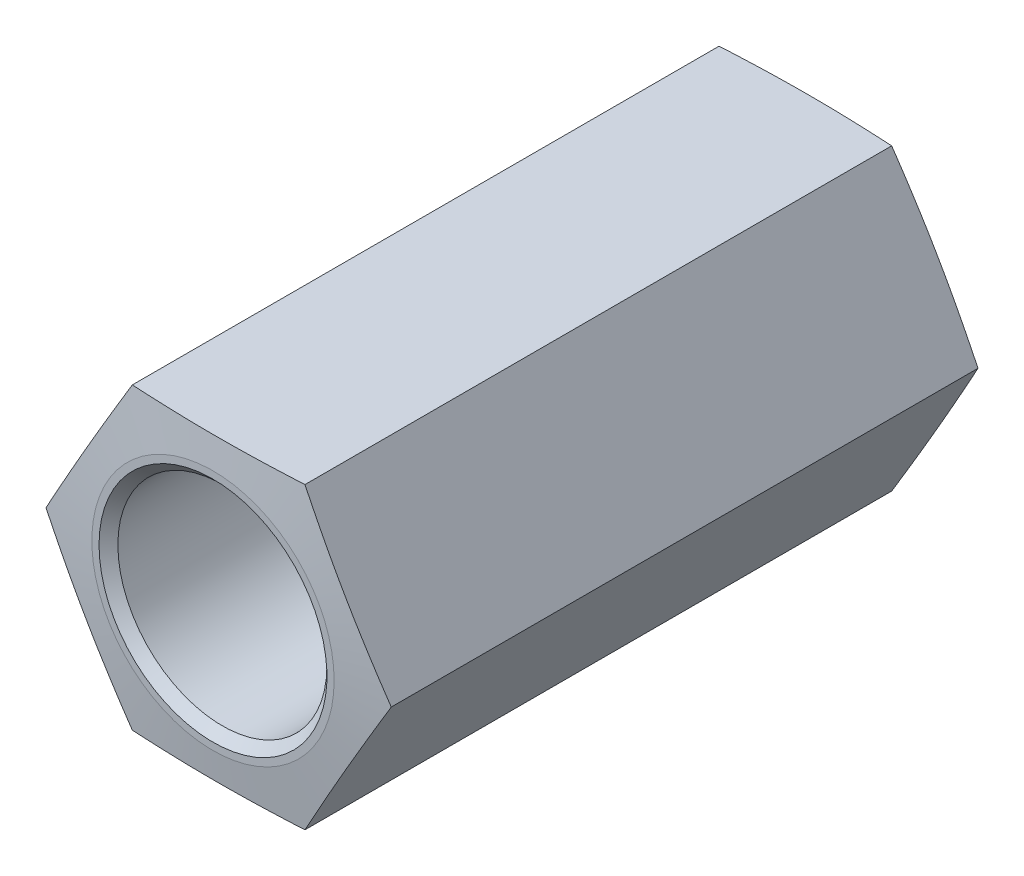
ISO-10303-21;
HEADER;
FILE_DESCRIPTION(('STEP AP214'),'2;1');
FILE_NAME('part.step','',(''),(''),'','','');
FILE_SCHEMA(('AUTOMOTIVE_DESIGN { 1 0 10303 214 1 1 1 1 }'));
ENDSEC;
DATA;
#1=APPLICATION_CONTEXT('core data for automotive mechanical design processes');
#2=APPLICATION_PROTOCOL_DEFINITION('international standard','automotive_design',2000,#1);
#3=PRODUCT_CONTEXT('',#1,'mechanical');
#4=PRODUCT('Part','Part','',(#3));
#5=PRODUCT_RELATED_PRODUCT_CATEGORY('part','',(#4));
#6=PRODUCT_DEFINITION_FORMATION('','',#4);
#7=PRODUCT_DEFINITION_CONTEXT('part definition',#1,'design');
#8=PRODUCT_DEFINITION('design','',#6,#7);
#9=PRODUCT_DEFINITION_SHAPE('','',#8);
#10=(LENGTH_UNIT() NAMED_UNIT(*) SI_UNIT(.MILLI.,.METRE.));
#11=(NAMED_UNIT(*) PLANE_ANGLE_UNIT() SI_UNIT($,.RADIAN.));
#12=(NAMED_UNIT(*) SI_UNIT($,.STERADIAN.) SOLID_ANGLE_UNIT());
#13=UNCERTAINTY_MEASURE_WITH_UNIT(LENGTH_MEASURE(1.E-05),#10,'distance_accuracy_value','');
#14=(GEOMETRIC_REPRESENTATION_CONTEXT(3) GLOBAL_UNCERTAINTY_ASSIGNED_CONTEXT((#13)) GLOBAL_UNIT_ASSIGNED_CONTEXT((#10,
#11,#12)) REPRESENTATION_CONTEXT('',''));
#15=CARTESIAN_POINT('',(0.,0.,0.));
#16=DIRECTION('',(0.,0.,1.));
#17=DIRECTION('',(1.,0.,0.));
#18=AXIS2_PLACEMENT_3D('',#15,#16,#17);
#19=CARTESIAN_POINT('',(3.6427233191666E-08,6.34999999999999,6.35));
#20=DIRECTION('',(0.,0.,-1.));
#21=DIRECTION('',(-1.,0.,0.));
#22=AXIS2_PLACEMENT_3D('',#19,#20,#21);
#23=PLANE('',#22);
#24=CARTESIAN_POINT('',(0.,-6.30938595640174E-08,6.35));
#25=DIRECTION('',(0.,0.,1.));
#26=DIRECTION('',(1.,0.,0.));
#27=AXIS2_PLACEMENT_3D('',#24,#25,#26);
#28=CIRCLE('',#27,2.57273925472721);
#29=CARTESIAN_POINT('',(2.57273925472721,-6.30938595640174E-08,6.35));
#30=VERTEX_POINT('',#29);
#31=EDGE_CURVE('E102',#30,#30,#28,.T.);
#32=ORIENTED_EDGE('',*,*,#31,.T.);
#33=EDGE_LOOP('',(#32));
#34=FACE_BOUND('',#33,.T.);
#35=CARTESIAN_POINT('',(0.,-6.30938595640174E-08,6.35));
#36=DIRECTION('',(0.,0.,-1.));
#37=DIRECTION('',(-1.,0.,0.));
#38=AXIS2_PLACEMENT_3D('',#35,#36,#37);
#39=CIRCLE('',#38,2.42000000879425);
#40=CARTESIAN_POINT('',(-2.42000000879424,-6.30938595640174E-08,6.35));
#41=VERTEX_POINT('',#40);
#42=EDGE_CURVE('E124',#41,#41,#39,.T.);
#43=ORIENTED_EDGE('',*,*,#42,.T.);
#44=EDGE_LOOP('',(#43));
#45=FACE_BOUND('',#44,.T.);
#46=ADVANCED_FACE('F30',(#34,#45),#23,.F.);
#47=CARTESIAN_POINT('',(3.6427233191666E-08,6.34999999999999,-6.35));
#48=DIRECTION('',(0.,0.,-1.));
#49=DIRECTION('',(-1.,0.,0.));
#50=AXIS2_PLACEMENT_3D('',#47,#48,#49);
#51=PLANE('',#50);
#52=CARTESIAN_POINT('',(0.,-6.30938595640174E-08,-6.35));
#53=DIRECTION('',(0.,0.,1.));
#54=DIRECTION('',(1.,0.,0.));
#55=AXIS2_PLACEMENT_3D('',#52,#53,#54);
#56=CIRCLE('',#55,2.57273925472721);
#57=CARTESIAN_POINT('',(2.57273925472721,-6.30938595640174E-08,-6.35));
#58=VERTEX_POINT('',#57);
#59=EDGE_CURVE('E222',#58,#58,#56,.T.);
#60=ORIENTED_EDGE('',*,*,#59,.F.);
#61=EDGE_LOOP('',(#60));
#62=FACE_BOUND('',#61,.T.);
#63=CARTESIAN_POINT('',(0.,-6.30938595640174E-08,-6.35));
#64=DIRECTION('',(0.,0.,-1.));
#65=DIRECTION('',(-1.,0.,0.));
#66=AXIS2_PLACEMENT_3D('',#63,#64,#65);
#67=CIRCLE('',#66,2.42000000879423);
#68=CARTESIAN_POINT('',(-2.42000000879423,-6.30938595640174E-08,-6.35));
#69=VERTEX_POINT('',#68);
#70=EDGE_CURVE('E127',#69,#69,#67,.F.);
#71=ORIENTED_EDGE('',*,*,#70,.T.);
#72=EDGE_LOOP('',(#71));
#73=FACE_BOUND('',#72,.T.);
#74=ADVANCED_FACE('F144',(#62,#73),#51,.T.);
#75=CARTESIAN_POINT('',(-1.83308710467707,3.17499993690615,6.35));
#76=DIRECTION('',(0.866025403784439,-0.5,0.));
#77=DIRECTION('',(0.5,0.866025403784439,0.));
#78=AXIS2_PLACEMENT_3D('',#75,#76,#77);
#79=PLANE('',#78);
#80=DIRECTION('',(0.,0.,-1.));
#81=VECTOR('',#80,1.);
#82=CARTESIAN_POINT('',(-3.66617420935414,-6.30938550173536E-08,6.35));
#83=LINE('',#82,#81);
#84=CARTESIAN_POINT('',(-3.66617420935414,-6.30938541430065E-08,6.23));
#85=VERTEX_POINT('',#84);
#86=CARTESIAN_POINT('',(-3.66617420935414,-6.30938541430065E-08,-6.23));
#87=VERTEX_POINT('',#86);
#88=EDGE_CURVE('E116',#85,#87,#83,.T.);
#89=ORIENTED_EDGE('',*,*,#88,.F.);
#90=CARTESIAN_POINT('',(-3.66628967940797,-0.000200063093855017,6.22998732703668));
#91=CARTESIAN_POINT('',(-3.58994462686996,0.132033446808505,6.23837017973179));
#92=CARTESIAN_POINT('',(-3.51357601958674,0.264307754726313,6.24596501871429));
#93=CARTESIAN_POINT('',(-3.36079345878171,0.528934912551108,6.25929019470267));
#94=CARTESIAN_POINT('',(-3.28437950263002,0.661287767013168,6.26502041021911));
#95=CARTESIAN_POINT('',(-3.13158459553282,0.925936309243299,6.27432264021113));
#96=CARTESIAN_POINT('',(-3.05520367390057,1.05823194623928,6.27789653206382));
#97=CARTESIAN_POINT('',(-2.90242538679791,1.32285170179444,6.28268735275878));
#98=CARTESIAN_POINT('',(-2.82602802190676,1.45517581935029,6.28390435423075));
#99=CARTESIAN_POINT('',(-2.67323329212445,1.719824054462,6.28390435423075));
#100=CARTESIAN_POINT('',(-2.5968359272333,1.85214817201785,6.28268735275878));
#101=CARTESIAN_POINT('',(-2.44405764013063,2.11676792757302,6.27789653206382));
#102=CARTESIAN_POINT('',(-2.36767671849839,2.249063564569,6.27432264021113));
#103=CARTESIAN_POINT('',(-2.21488181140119,2.51371210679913,6.26502041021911));
#104=CARTESIAN_POINT('',(-2.1384678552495,2.64606496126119,6.25929019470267));
#105=CARTESIAN_POINT('',(-1.98568529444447,2.91069211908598,6.24596501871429));
#106=CARTESIAN_POINT('',(-1.90931668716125,3.04296642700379,6.23837017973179));
#107=CARTESIAN_POINT('',(-1.83297163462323,3.17519993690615,6.22998732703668));
#108=B_SPLINE_CURVE_WITH_KNOTS('',3,(#90,#91,#92,#93,#94,#95,#96,#97,#98,#99,#100,#101,#102,
#103,#104,#105,#106,#107),.UNSPECIFIED.,.F.,.F.,(4,2,2,2,2,2,2,2,4),(0.,0.458763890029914,
0.917557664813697,1.37595141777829,1.83433104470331,2.29271067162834,2.75110442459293,
3.20989819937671,3.66866208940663),.UNSPECIFIED.);
#109=CARTESIAN_POINT('',(-1.83308710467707,3.17499993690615,6.23));
#110=VERTEX_POINT('',#109);
#111=EDGE_CURVE('E187',#85,#110,#108,.T.);
#112=ORIENTED_EDGE('',*,*,#111,.T.);
#113=DIRECTION('',(0.,0.,-1.));
#114=VECTOR('',#113,1.);
#115=CARTESIAN_POINT('',(-1.83308710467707,3.17499993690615,6.35));
#116=LINE('',#115,#114);
#117=CARTESIAN_POINT('',(-1.83308710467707,3.17499993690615,-6.23));
#118=VERTEX_POINT('',#117);
#119=EDGE_CURVE('E57',#110,#118,#116,.T.);
#120=ORIENTED_EDGE('',*,*,#119,.T.);
#121=CARTESIAN_POINT('',(-1.83297163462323,3.17519993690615,-6.22998732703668));
#122=CARTESIAN_POINT('',(-1.90931668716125,3.04296642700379,-6.23837017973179));
#123=CARTESIAN_POINT('',(-1.98568529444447,2.91069211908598,-6.24596501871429));
#124=CARTESIAN_POINT('',(-2.1384678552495,2.64606496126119,-6.25929019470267));
#125=CARTESIAN_POINT('',(-2.21488181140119,2.51371210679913,-6.26502041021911));
#126=CARTESIAN_POINT('',(-2.36767671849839,2.249063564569,-6.27432264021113));
#127=CARTESIAN_POINT('',(-2.44405764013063,2.11676792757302,-6.27789653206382));
#128=CARTESIAN_POINT('',(-2.5968359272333,1.85214817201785,-6.28268735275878));
#129=CARTESIAN_POINT('',(-2.67323329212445,1.719824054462,-6.28390435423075));
#130=CARTESIAN_POINT('',(-2.82602802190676,1.45517581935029,-6.28390435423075));
#131=CARTESIAN_POINT('',(-2.90242538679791,1.32285170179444,-6.28268735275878));
#132=CARTESIAN_POINT('',(-3.05520367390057,1.05823194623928,-6.27789653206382));
#133=CARTESIAN_POINT('',(-3.13158459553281,0.925936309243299,-6.27432264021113));
#134=CARTESIAN_POINT('',(-3.28437950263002,0.661287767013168,-6.26502041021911));
#135=CARTESIAN_POINT('',(-3.36079345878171,0.528934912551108,-6.25929019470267));
#136=CARTESIAN_POINT('',(-3.51357601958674,0.264307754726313,-6.24596501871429));
#137=CARTESIAN_POINT('',(-3.58994462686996,0.132033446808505,-6.23837017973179));
#138=CARTESIAN_POINT('',(-3.66628967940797,-0.000200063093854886,-6.22998732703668));
#139=B_SPLINE_CURVE_WITH_KNOTS('',3,(#121,#122,#123,#124,#125,#126,#127,#128,#129,#130,#131,
#132,#133,#134,#135,#136,#137,#138),.UNSPECIFIED.,.F.,.F.,(4,2,2,2,2,2,2,2,4),(0.,
0.458763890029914,0.917557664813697,1.37595141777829,1.83433104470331,2.29271067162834,
2.75110442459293,3.20989819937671,3.66866208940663),.UNSPECIFIED.);
#140=EDGE_CURVE('E209',#118,#87,#139,.T.);
#141=ORIENTED_EDGE('',*,*,#140,.T.);
#142=EDGE_LOOP('',(#89,#112,#120,#141));
#143=FACE_BOUND('',#142,.T.);
#144=ADVANCED_FACE('F196',(#143),#79,.F.);
#145=CARTESIAN_POINT('',(-3.66617420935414,-6.30938550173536E-08,6.35));
#146=DIRECTION('',(0.866025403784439,0.5,0.));
#147=DIRECTION('',(-0.5,0.866025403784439,0.));
#148=AXIS2_PLACEMENT_3D('',#145,#146,#147);
#149=PLANE('',#148);
#150=DIRECTION('',(0.,0.,-1.));
#151=VECTOR('',#150,1.);
#152=CARTESIAN_POINT('',(-1.83308710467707,-3.17500006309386,6.35));
#153=LINE('',#152,#151);
#154=CARTESIAN_POINT('',(-1.83308710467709,-3.17500006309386,6.23));
#155=VERTEX_POINT('',#154);
#156=CARTESIAN_POINT('',(-1.83308710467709,-3.17500006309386,-6.23));
#157=VERTEX_POINT('',#156);
#158=EDGE_CURVE('E110',#155,#157,#153,.T.);
#159=ORIENTED_EDGE('',*,*,#158,.F.);
#160=CARTESIAN_POINT('',(-1.83297163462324,-3.17520006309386,6.22998732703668));
#161=CARTESIAN_POINT('',(-1.90931668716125,-3.0429665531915,6.23837017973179));
#162=CARTESIAN_POINT('',(-1.98568529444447,-2.91069224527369,6.24596501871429));
#163=CARTESIAN_POINT('',(-2.1384678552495,-2.6460650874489,6.25929019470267));
#164=CARTESIAN_POINT('',(-2.21488181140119,-2.51371223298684,6.26502041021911));
#165=CARTESIAN_POINT('',(-2.36767671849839,-2.24906369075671,6.27432264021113));
#166=CARTESIAN_POINT('',(-2.44405764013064,-2.11676805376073,6.27789653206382));
#167=CARTESIAN_POINT('',(-2.5968359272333,-1.85214829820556,6.28268735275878));
#168=CARTESIAN_POINT('',(-2.67323329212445,-1.71982418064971,6.28390435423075));
#169=CARTESIAN_POINT('',(-2.82602802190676,-1.455175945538,6.28390435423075));
#170=CARTESIAN_POINT('',(-2.90242538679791,-1.32285182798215,6.28268735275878));
#171=CARTESIAN_POINT('',(-3.05520367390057,-1.05823207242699,6.27789653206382));
#172=CARTESIAN_POINT('',(-3.13158459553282,-0.925936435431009,6.27432264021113));
#173=CARTESIAN_POINT('',(-3.28437950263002,-0.661287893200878,6.26502041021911));
#174=CARTESIAN_POINT('',(-3.36079345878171,-0.528935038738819,6.25929019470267));
#175=CARTESIAN_POINT('',(-3.51357601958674,-0.264307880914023,6.24596501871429));
#176=CARTESIAN_POINT('',(-3.58994462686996,-0.132033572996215,6.23837017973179));
#177=CARTESIAN_POINT('',(-3.66628967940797,0.000199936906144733,6.22998732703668));
#178=B_SPLINE_CURVE_WITH_KNOTS('',3,(#160,#161,#162,#163,#164,#165,#166,#167,#168,#169,#170,
#171,#172,#173,#174,#175,#176,#177),.UNSPECIFIED.,.F.,.F.,(4,2,2,2,2,2,2,2,4),(0.,
0.458763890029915,0.917557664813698,1.37595141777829,1.83433104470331,2.29271067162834,
2.75110442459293,3.20989819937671,3.66866208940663),.UNSPECIFIED.);
#179=EDGE_CURVE('E181',#155,#85,#178,.T.);
#180=ORIENTED_EDGE('',*,*,#179,.T.);
#181=ORIENTED_EDGE('',*,*,#88,.T.);
#182=CARTESIAN_POINT('',(-3.66628967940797,0.000199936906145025,-6.22998732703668));
#183=CARTESIAN_POINT('',(-3.58994462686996,-0.132033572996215,-6.23837017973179));
#184=CARTESIAN_POINT('',(-3.51357601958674,-0.264307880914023,-6.24596501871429));
#185=CARTESIAN_POINT('',(-3.36079345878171,-0.528935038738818,-6.25929019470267));
#186=CARTESIAN_POINT('',(-3.28437950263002,-0.661287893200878,-6.26502041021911));
#187=CARTESIAN_POINT('',(-3.13158459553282,-0.925936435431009,-6.27432264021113));
#188=CARTESIAN_POINT('',(-3.05520367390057,-1.05823207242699,-6.27789653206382));
#189=CARTESIAN_POINT('',(-2.90242538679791,-1.32285182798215,-6.28268735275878));
#190=CARTESIAN_POINT('',(-2.82602802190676,-1.455175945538,-6.28390435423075));
#191=CARTESIAN_POINT('',(-2.67323329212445,-1.71982418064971,-6.28390435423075));
#192=CARTESIAN_POINT('',(-2.5968359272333,-1.85214829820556,-6.28268735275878));
#193=CARTESIAN_POINT('',(-2.44405764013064,-2.11676805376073,-6.27789653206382));
#194=CARTESIAN_POINT('',(-2.36767671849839,-2.24906369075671,-6.27432264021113));
#195=CARTESIAN_POINT('',(-2.21488181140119,-2.51371223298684,-6.26502041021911));
#196=CARTESIAN_POINT('',(-2.1384678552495,-2.6460650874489,-6.25929019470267));
#197=CARTESIAN_POINT('',(-1.98568529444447,-2.91069224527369,-6.24596501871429));
#198=CARTESIAN_POINT('',(-1.90931668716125,-3.0429665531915,-6.23837017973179));
#199=CARTESIAN_POINT('',(-1.83297163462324,-3.17520006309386,-6.22998732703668));
#200=B_SPLINE_CURVE_WITH_KNOTS('',3,(#182,#183,#184,#185,#186,#187,#188,#189,#190,#191,#192,
#193,#194,#195,#196,#197,#198,#199),.UNSPECIFIED.,.F.,.F.,(4,2,2,2,2,2,2,2,4),(0.,
0.458763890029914,0.917557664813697,1.37595141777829,1.83433104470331,2.29271067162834,
2.75110442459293,3.20989819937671,3.66866208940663),.UNSPECIFIED.);
#201=EDGE_CURVE('E202',#87,#157,#200,.T.);
#202=ORIENTED_EDGE('',*,*,#201,.T.);
#203=EDGE_LOOP('',(#159,#180,#181,#202));
#204=FACE_BOUND('',#203,.T.);
#205=ADVANCED_FACE('F192',(#204),#149,.F.);
#206=CARTESIAN_POINT('',(-1.83308710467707,-3.17500006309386,6.35));
#207=DIRECTION('',(-3.44194550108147E-08,0.999999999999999,0.));
#208=DIRECTION('',(-0.999999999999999,-3.44194550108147E-08,0.));
#209=AXIS2_PLACEMENT_3D('',#206,#207,#208);
#210=PLANE('',#209);
#211=DIRECTION('',(0.,0.,-1.));
#212=VECTOR('',#211,1.);
#213=CARTESIAN_POINT('',(1.83308710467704,-3.17499993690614,6.35));
#214=LINE('',#213,#212);
#215=CARTESIAN_POINT('',(1.83308699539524,-3.17500012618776,6.23));
#216=VERTEX_POINT('',#215);
#217=CARTESIAN_POINT('',(1.83308699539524,-3.17500012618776,-6.23));
#218=VERTEX_POINT('',#217);
#219=EDGE_CURVE('E108',#216,#218,#214,.T.);
#220=ORIENTED_EDGE('',*,*,#219,.F.);
#221=CARTESIAN_POINT('',(-4.83494791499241,-3.17500016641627,5.99755177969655));
#222=CARTESIAN_POINT('',(-4.69083344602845,-3.17500016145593,6.01077005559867));
#223=CARTESIAN_POINT('',(-4.54670317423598,-3.17500015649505,6.02381620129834));
#224=CARTESIAN_POINT('',(-4.25840335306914,-3.17500014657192,6.04947917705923));
#225=CARTESIAN_POINT('',(-4.11423380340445,-3.17500014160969,6.06209600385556));
#226=CARTESIAN_POINT('',(-3.68161123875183,-3.17500012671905,6.09917863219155));
#227=CARTESIAN_POINT('',(-3.39309105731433,-3.17500011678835,6.12287223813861));
#228=CARTESIAN_POINT('',(-2.8161799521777,-3.17500009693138,6.16713632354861));
#229=CARTESIAN_POINT('',(-2.52778933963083,-3.17500008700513,6.18771078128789));
#230=CARTESIAN_POINT('',(-1.95071438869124,-3.17500006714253,6.22421217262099));
#231=CARTESIAN_POINT('',(-1.66203005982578,-3.17500005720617,6.2401392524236));
#232=CARTESIAN_POINT('',(-1.08383678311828,-3.17500003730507,6.26530552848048));
#233=CARTESIAN_POINT('',(-0.794327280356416,-3.17500002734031,6.27453282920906));
#234=CARTESIAN_POINT('',(-0.359965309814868,-3.17500001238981,6.28202648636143));
#235=CARTESIAN_POINT('',(-0.21516514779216,-3.17500000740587,6.28346653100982));
#236=CARTESIAN_POINT('',(0.0744404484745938,-3.1749999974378,6.28417108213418));
#237=CARTESIAN_POINT('',(0.219245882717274,-3.17499999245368,6.28343558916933));
#238=CARTESIAN_POINT('',(0.653794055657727,-3.17499997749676,6.27799104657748));
#239=CARTESIAN_POINT('',(0.943499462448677,-3.17499996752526,6.27004101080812));
#240=CARTESIAN_POINT('',(1.52263859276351,-3.17499994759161,6.24705711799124));
#241=CARTESIAN_POINT('',(1.81207228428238,-3.17499993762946,6.23202251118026));
#242=CARTESIAN_POINT('',(2.37658945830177,-3.17499991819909,6.19782984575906));
#243=CARTESIAN_POINT('',(2.65168769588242,-3.17499990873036,6.17890730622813));
#244=CARTESIAN_POINT('',(3.20165867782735,-3.17499988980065,6.13799900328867));
#245=CARTESIAN_POINT('',(3.47653141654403,-3.17499988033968,6.11601316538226));
#246=CARTESIAN_POINT('',(4.02611836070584,-3.1749998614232,6.06997277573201));
#247=CARTESIAN_POINT('',(4.30083255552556,-3.17499985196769,6.04591809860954));
#248=CARTESIAN_POINT('',(4.85013324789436,-3.17499983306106,5.99638968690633));
#249=CARTESIAN_POINT('',(5.1247197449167,-3.17499982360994,5.97091594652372));
#250=CARTESIAN_POINT('',(5.67334348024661,-3.17499980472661,5.91901454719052));
#251=CARTESIAN_POINT('',(5.94738087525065,-3.17499979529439,5.89258853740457));
#252=CARTESIAN_POINT('',(6.4953862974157,-3.17499977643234,5.8390190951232));
#253=CARTESIAN_POINT('',(6.76935432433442,-3.17499976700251,5.81187566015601));
#254=CARTESIAN_POINT('',(7.31716608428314,-3.17499974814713,5.75706763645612));
#255=CARTESIAN_POINT('',(7.59100983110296,-3.17499973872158,5.72940318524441));
#256=CARTESIAN_POINT('',(8.13865420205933,-3.17499971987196,5.67366761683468));
#257=CARTESIAN_POINT('',(8.41245482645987,-3.17499971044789,5.64559650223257));
#258=CARTESIAN_POINT('',(8.68624054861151,-3.17499970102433,5.61738255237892));
#259=B_SPLINE_CURVE_WITH_KNOTS('',3,(#221,#222,#223,#224,#225,#226,#227,#228,#229,#230,#231,
#232,#233,#234,#235,#236,#237,#238,#239,#240,#241,#242,#243,#244,#245,#246,#247,#248,#249,#250,
#251,#252,#253,#254,#255,#256,#257,#258),.UNSPECIFIED.,.F.,.F.,(4,2,2,2,2,2,2,2,2,2,2,2,2,2,2,2,
2,2,4),(0.,0.434157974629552,0.868319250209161,1.7367826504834,2.60412888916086,
3.47144783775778,4.34030297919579,4.77470987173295,5.20911665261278,6.07843767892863,
6.94785072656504,7.77507130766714,8.60231200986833,9.42960288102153,10.2568971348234,
11.0828216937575,11.9087490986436,12.734461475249,13.5601685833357),.UNSPECIFIED.);
#260=EDGE_CURVE('E90',#216,#155,#259,.F.);
#261=ORIENTED_EDGE('',*,*,#260,.T.);
#262=ORIENTED_EDGE('',*,*,#158,.T.);
#263=CARTESIAN_POINT('',(-4.83494791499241,-3.17500016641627,-5.99755177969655));
#264=CARTESIAN_POINT('',(-4.69083344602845,-3.17500016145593,-6.01077005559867));
#265=CARTESIAN_POINT('',(-4.54670317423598,-3.17500015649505,-6.02381620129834));
#266=CARTESIAN_POINT('',(-4.25840335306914,-3.17500014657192,-6.04947917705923));
#267=CARTESIAN_POINT('',(-4.11423380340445,-3.17500014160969,-6.06209600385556));
#268=CARTESIAN_POINT('',(-3.68161123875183,-3.17500012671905,-6.09917863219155));
#269=CARTESIAN_POINT('',(-3.39309105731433,-3.17500011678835,-6.12287223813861));
#270=CARTESIAN_POINT('',(-2.8161799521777,-3.17500009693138,-6.16713632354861));
#271=CARTESIAN_POINT('',(-2.52778933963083,-3.17500008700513,-6.18771078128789));
#272=CARTESIAN_POINT('',(-1.95071438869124,-3.17500006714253,-6.22421217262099));
#273=CARTESIAN_POINT('',(-1.66203005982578,-3.17500005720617,-6.2401392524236));
#274=CARTESIAN_POINT('',(-1.08383678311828,-3.17500003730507,-6.26530552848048));
#275=CARTESIAN_POINT('',(-0.794327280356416,-3.17500002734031,-6.27453282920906));
#276=CARTESIAN_POINT('',(-0.359965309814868,-3.17500001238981,-6.28202648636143));
#277=CARTESIAN_POINT('',(-0.21516514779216,-3.17500000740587,-6.28346653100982));
#278=CARTESIAN_POINT('',(0.0744404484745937,-3.1749999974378,-6.28417108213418));
#279=CARTESIAN_POINT('',(0.219245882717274,-3.17499999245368,-6.28343558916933));
#280=CARTESIAN_POINT('',(0.653794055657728,-3.17499997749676,-6.27799104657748));
#281=CARTESIAN_POINT('',(0.943499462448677,-3.17499996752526,-6.27004101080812));
#282=CARTESIAN_POINT('',(1.52263859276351,-3.17499994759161,-6.24705711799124));
#283=CARTESIAN_POINT('',(1.81207228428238,-3.17499993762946,-6.23202251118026));
#284=CARTESIAN_POINT('',(2.37658945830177,-3.17499991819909,-6.19782984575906));
#285=CARTESIAN_POINT('',(2.65168769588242,-3.17499990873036,-6.17890730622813));
#286=CARTESIAN_POINT('',(3.20165867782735,-3.17499988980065,-6.13799900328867));
#287=CARTESIAN_POINT('',(3.47653141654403,-3.17499988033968,-6.11601316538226));
#288=CARTESIAN_POINT('',(4.02611836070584,-3.1749998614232,-6.06997277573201));
#289=CARTESIAN_POINT('',(4.30083255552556,-3.17499985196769,-6.04591809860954));
#290=CARTESIAN_POINT('',(4.85013324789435,-3.17499983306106,-5.99638968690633));
#291=CARTESIAN_POINT('',(5.1247197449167,-3.17499982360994,-5.97091594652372));
#292=CARTESIAN_POINT('',(5.67334348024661,-3.17499980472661,-5.91901454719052));
#293=CARTESIAN_POINT('',(5.94738087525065,-3.17499979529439,-5.89258853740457));
#294=CARTESIAN_POINT('',(6.4953862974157,-3.17499977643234,-5.8390190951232));
#295=CARTESIAN_POINT('',(6.76935432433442,-3.17499976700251,-5.81187566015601));
#296=CARTESIAN_POINT('',(7.31716608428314,-3.17499974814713,-5.75706763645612));
#297=CARTESIAN_POINT('',(7.59100983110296,-3.17499973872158,-5.72940318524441));
#298=CARTESIAN_POINT('',(8.13865420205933,-3.17499971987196,-5.67366761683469));
#299=CARTESIAN_POINT('',(8.41245482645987,-3.17499971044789,-5.64559650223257));
#300=CARTESIAN_POINT('',(8.68624054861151,-3.17499970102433,-5.61738255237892));
#301=B_SPLINE_CURVE_WITH_KNOTS('',3,(#263,#264,#265,#266,#267,#268,#269,#270,#271,#272,#273,
#274,#275,#276,#277,#278,#279,#280,#281,#282,#283,#284,#285,#286,#287,#288,#289,#290,#291,#292,
#293,#294,#295,#296,#297,#298,#299,#300),.UNSPECIFIED.,.F.,.F.,(4,2,2,2,2,2,2,2,2,2,2,2,2,2,2,2,
2,2,4),(0.,0.434157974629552,0.868319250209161,1.7367826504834,2.60412888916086,
3.47144783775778,4.34030297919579,4.77470987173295,5.20911665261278,6.07843767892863,
6.94785072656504,7.77507130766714,8.60231200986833,9.42960288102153,10.2568971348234,
11.0828216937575,11.9087490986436,12.734461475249,13.5601685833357),.UNSPECIFIED.);
#302=EDGE_CURVE('E210',#157,#218,#301,.T.);
#303=ORIENTED_EDGE('',*,*,#302,.T.);
#304=EDGE_LOOP('',(#220,#261,#262,#303));
#305=FACE_BOUND('',#304,.T.);
#306=ADVANCED_FACE('F195',(#305),#210,.F.);
#307=CARTESIAN_POINT('',(1.83308710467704,-3.17499993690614,6.35));
#308=DIRECTION('',(-0.866025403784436,0.500000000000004,0.));
#309=DIRECTION('',(-0.500000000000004,-0.866025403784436,0.));
#310=AXIS2_PLACEMENT_3D('',#307,#308,#309);
#311=PLANE('',#310);
#312=DIRECTION('',(0.,0.,-1.));
#313=VECTOR('',#312,1.);
#314=CARTESIAN_POINT('',(3.66617420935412,6.3093853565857E-08,6.35));
#315=LINE('',#314,#313);
#316=CARTESIAN_POINT('',(3.66617420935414,6.30938224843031E-08,6.23));
#317=VERTEX_POINT('',#316);
#318=CARTESIAN_POINT('',(3.66617420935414,6.30938224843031E-08,-6.23));
#319=VERTEX_POINT('',#318);
#320=EDGE_CURVE('E99',#317,#319,#315,.T.);
#321=ORIENTED_EDGE('',*,*,#320,.F.);
#322=CARTESIAN_POINT('',(3.66628967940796,0.000200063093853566,6.22998732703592));
#323=CARTESIAN_POINT('',(3.58994462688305,-0.132033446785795,6.23837018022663));
#324=CARTESIAN_POINT('',(3.51357601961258,-0.264307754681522,6.24596501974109));
#325=CARTESIAN_POINT('',(3.36079345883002,-0.528934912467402,6.25929019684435));
#326=CARTESIAN_POINT('',(3.28437950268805,-0.661287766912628,6.2650204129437));
#327=CARTESIAN_POINT('',(3.13158459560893,-0.925936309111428,6.27432264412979));
#328=CARTESIAN_POINT('',(3.05520367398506,-1.0582319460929,6.27789653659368));
#329=CARTESIAN_POINT('',(2.90242538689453,-1.32285170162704,6.28268735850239));
#330=CARTESIAN_POINT('',(2.82602802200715,-1.45517581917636,6.2839043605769));
#331=CARTESIAN_POINT('',(2.67323329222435,-1.71982405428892,6.28390436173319));
#332=CARTESIAN_POINT('',(2.59683592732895,-1.85214817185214,6.28268736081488));
#333=CARTESIAN_POINT('',(2.44405764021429,-2.11676792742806,6.27789654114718));
#334=CARTESIAN_POINT('',(2.36767671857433,-2.24906356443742,6.27432264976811));
#335=CARTESIAN_POINT('',(2.21488181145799,-2.51371210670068,6.26502042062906));
#336=CARTESIAN_POINT('',(2.1384678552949,-2.64606496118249,6.25929020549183));
#337=CARTESIAN_POINT('',(1.9856852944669,-2.91069211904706,6.24596503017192));
#338=CARTESIAN_POINT('',(1.90931668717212,-3.0429664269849,6.23837019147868));
#339=CARTESIAN_POINT('',(1.8329716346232,-3.17519993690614,6.22998733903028));
#340=B_SPLINE_CURVE_WITH_KNOTS('',3,(#322,#323,#324,#325,#326,#327,#328,#329,#330,#331,#332,
#333,#334,#335,#336,#337,#338,#339),.UNSPECIFIED.,.F.,.F.,(4,2,2,2,2,2,2,2,4),(0.,
0.45876389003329,0.917557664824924,1.37595141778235,1.8343310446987,2.29271067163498,
2.75110442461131,3.20989819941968,3.66866208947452),.UNSPECIFIED.);
#341=EDGE_CURVE('E87',#317,#216,#340,.T.);
#342=ORIENTED_EDGE('',*,*,#341,.T.);
#343=ORIENTED_EDGE('',*,*,#219,.T.);
#344=CARTESIAN_POINT('',(1.8329716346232,-3.17519993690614,-6.22998733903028));
#345=CARTESIAN_POINT('',(1.90931668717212,-3.0429664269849,-6.23837019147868));
#346=CARTESIAN_POINT('',(1.9856852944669,-2.91069211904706,-6.24596503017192));
#347=CARTESIAN_POINT('',(2.1384678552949,-2.64606496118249,-6.25929020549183));
#348=CARTESIAN_POINT('',(2.21488181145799,-2.51371210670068,-6.26502042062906));
#349=CARTESIAN_POINT('',(2.36767671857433,-2.24906356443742,-6.27432264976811));
#350=CARTESIAN_POINT('',(2.44405764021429,-2.11676792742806,-6.27789654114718));
#351=CARTESIAN_POINT('',(2.59683592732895,-1.85214817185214,-6.28268736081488));
#352=CARTESIAN_POINT('',(2.67323329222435,-1.71982405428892,-6.28390436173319));
#353=CARTESIAN_POINT('',(2.82602802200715,-1.45517581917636,-6.2839043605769));
#354=CARTESIAN_POINT('',(2.90242538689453,-1.32285170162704,-6.28268735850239));
#355=CARTESIAN_POINT('',(3.05520367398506,-1.0582319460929,-6.27789653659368));
#356=CARTESIAN_POINT('',(3.13158459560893,-0.925936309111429,-6.27432264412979));
#357=CARTESIAN_POINT('',(3.28437950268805,-0.661287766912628,-6.2650204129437));
#358=CARTESIAN_POINT('',(3.36079345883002,-0.528934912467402,-6.25929019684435));
#359=CARTESIAN_POINT('',(3.51357601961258,-0.264307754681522,-6.24596501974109));
#360=CARTESIAN_POINT('',(3.58994462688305,-0.132033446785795,-6.23837018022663));
#361=CARTESIAN_POINT('',(3.66628967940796,0.000200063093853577,-6.22998732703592));
#362=B_SPLINE_CURVE_WITH_KNOTS('',3,(#344,#345,#346,#347,#348,#349,#350,#351,#352,#353,#354,
#355,#356,#357,#358,#359,#360,#361),.UNSPECIFIED.,.F.,.F.,(4,2,2,2,2,2,2,2,4),(0.,
0.458763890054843,0.917557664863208,1.37595141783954,1.83433104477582,2.29271067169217,
2.7511044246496,3.20989819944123,3.66866208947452),.UNSPECIFIED.);
#363=EDGE_CURVE('E107',#218,#319,#362,.T.);
#364=ORIENTED_EDGE('',*,*,#363,.T.);
#365=EDGE_LOOP('',(#321,#342,#343,#364));
#366=FACE_BOUND('',#365,.T.);
#367=ADVANCED_FACE('F105',(#366),#311,.F.);
#368=CARTESIAN_POINT('',(3.66617420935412,6.3093853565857E-08,6.35));
#369=DIRECTION('',(-0.866025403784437,-0.500000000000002,0.));
#370=DIRECTION('',(0.500000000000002,-0.866025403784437,0.));
#371=AXIS2_PLACEMENT_3D('',#368,#369,#370);
#372=PLANE('',#371);
#373=DIRECTION('',(0.,0.,-1.));
#374=VECTOR('',#373,1.);
#375=CARTESIAN_POINT('',(1.83308710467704,3.17500006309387,6.35));
#376=LINE('',#375,#374);
#377=CARTESIAN_POINT('',(1.83308710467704,3.17500006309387,6.22999998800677));
#378=VERTEX_POINT('',#377);
#379=CARTESIAN_POINT('',(1.83308688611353,3.17500006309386,-6.23));
#380=VERTEX_POINT('',#379);
#381=EDGE_CURVE('E101',#378,#380,#376,.T.);
#382=ORIENTED_EDGE('',*,*,#381,.F.);
#383=CARTESIAN_POINT('',(1.8329716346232,3.17520006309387,6.22998731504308));
#384=CARTESIAN_POINT('',(1.90931668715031,3.04296655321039,6.2383701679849));
#385=CARTESIAN_POINT('',(1.98568529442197,2.91069224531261,6.24596500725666));
#386=CARTESIAN_POINT('',(2.13846785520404,2.64606508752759,6.25929018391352));
#387=CARTESIAN_POINT('',(2.21488181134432,2.51371223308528,6.26502039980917));
#388=CARTESIAN_POINT('',(2.3676767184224,2.24906369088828,6.27432263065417));
#389=CARTESIAN_POINT('',(2.44405764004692,2.11676805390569,6.27789652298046));
#390=CARTESIAN_POINT('',(2.5968359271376,1.85214829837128,6.28268734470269));
#391=CARTESIAN_POINT('',(2.6732332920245,1.71982418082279,6.28390434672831));
#392=CARTESIAN_POINT('',(2.82602802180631,1.45517594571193,6.28390434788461));
#393=CARTESIAN_POINT('',(2.90242538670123,1.32285182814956,6.28268734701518));
#394=CARTESIAN_POINT('',(3.05520367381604,1.05823207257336,6.27789652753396));
#395=CARTESIAN_POINT('',(3.13158459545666,0.925936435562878,6.27432263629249));
#396=CARTESIAN_POINT('',(3.28437950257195,0.661287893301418,6.26502040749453));
#397=CARTESIAN_POINT('',(3.36079345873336,0.528935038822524,6.259290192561));
#398=CARTESIAN_POINT('',(3.51357601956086,0.264307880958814,6.24596501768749));
#399=CARTESIAN_POINT('',(3.58994462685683,0.132033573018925,6.23837017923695));
#400=CARTESIAN_POINT('',(3.66628967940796,-0.000199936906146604,6.22998732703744));
#401=B_SPLINE_CURVE_WITH_KNOTS('',3,(#383,#384,#385,#386,#387,#388,#389,#390,#391,#392,#393,
#394,#395,#396,#397,#398,#399,#400),.UNSPECIFIED.,.F.,.F.,(4,2,2,2,2,2,2,2,4),(0.,
0.458763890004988,0.917557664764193,1.37595141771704,1.83433104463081,2.29271067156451,
2.75110442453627,3.20989819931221,3.66866208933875),.UNSPECIFIED.);
#402=EDGE_CURVE('E50',#378,#317,#401,.T.);
#403=ORIENTED_EDGE('',*,*,#402,.T.);
#404=ORIENTED_EDGE('',*,*,#320,.T.);
#405=CARTESIAN_POINT('',(3.66628967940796,-0.000199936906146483,-6.22998732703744));
#406=CARTESIAN_POINT('',(3.58994462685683,0.132033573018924,-6.23837017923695));
#407=CARTESIAN_POINT('',(3.51357601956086,0.264307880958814,-6.24596501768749));
#408=CARTESIAN_POINT('',(3.36079345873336,0.528935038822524,-6.259290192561));
#409=CARTESIAN_POINT('',(3.28437950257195,0.661287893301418,-6.26502040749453));
#410=CARTESIAN_POINT('',(3.13158459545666,0.925936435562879,-6.27432263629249));
#411=CARTESIAN_POINT('',(3.05520367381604,1.05823207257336,-6.27789652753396));
#412=CARTESIAN_POINT('',(2.90242538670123,1.32285182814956,-6.28268734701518));
#413=CARTESIAN_POINT('',(2.82602802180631,1.45517594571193,-6.28390434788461));
#414=CARTESIAN_POINT('',(2.6732332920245,1.71982418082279,-6.28390434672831));
#415=CARTESIAN_POINT('',(2.5968359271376,1.85214829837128,-6.28268734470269));
#416=CARTESIAN_POINT('',(2.44405764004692,2.11676805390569,-6.27789652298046));
#417=CARTESIAN_POINT('',(2.3676767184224,2.24906369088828,-6.27432263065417));
#418=CARTESIAN_POINT('',(2.21488181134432,2.51371223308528,-6.26502039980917));
#419=CARTESIAN_POINT('',(2.13846785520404,2.64606508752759,-6.25929018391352));
#420=CARTESIAN_POINT('',(1.98568529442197,2.91069224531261,-6.24596500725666));
#421=CARTESIAN_POINT('',(1.90931668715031,3.04296655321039,-6.2383701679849));
#422=CARTESIAN_POINT('',(1.8329716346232,3.17520006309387,-6.22998731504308));
#423=B_SPLINE_CURVE_WITH_KNOTS('',3,(#405,#406,#407,#408,#409,#410,#411,#412,#413,#414,#415,
#416,#417,#418,#419,#420,#421,#422),.UNSPECIFIED.,.F.,.F.,(4,2,2,2,2,2,2,2,4),(0.,
0.45876389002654,0.917557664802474,1.37595141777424,1.83433104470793,2.2927106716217,
2.75110442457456,3.20989819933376,3.66866208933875),.UNSPECIFIED.);
#424=EDGE_CURVE('E154',#319,#380,#423,.T.);
#425=ORIENTED_EDGE('',*,*,#424,.T.);
#426=EDGE_LOOP('',(#382,#403,#404,#425));
#427=FACE_BOUND('',#426,.T.);
#428=ADVANCED_FACE('F97',(#427),#372,.F.);
#429=CARTESIAN_POINT('',(1.83308710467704,3.17500006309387,6.35));
#430=DIRECTION('',(3.44194550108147E-08,-0.999999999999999,0.));
#431=DIRECTION('',(1.,3.44194550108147E-08,0.));
#432=AXIS2_PLACEMENT_3D('',#429,#430,#431);
#433=PLANE('',#432);
#434=ORIENTED_EDGE('',*,*,#119,.F.);
#435=CARTESIAN_POINT('',(-4.83495216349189,3.17499983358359,5.99755140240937));
#436=CARTESIAN_POINT('',(-4.69083751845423,3.17499983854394,6.0107696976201));
#437=CARTESIAN_POINT('',(-4.54670707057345,3.17499984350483,6.02381586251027));
#438=CARTESIAN_POINT('',(-4.25840689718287,3.17499985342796,6.04947887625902));
#439=CARTESIAN_POINT('',(-4.11423717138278,3.17499985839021,6.06209572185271));
#440=CARTESIAN_POINT('',(-3.68161407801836,3.17499987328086,6.09917840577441));
#441=CARTESIAN_POINT('',(-3.39309354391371,3.17499988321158,6.1228720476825));
#442=CARTESIAN_POINT('',(-2.81618173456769,3.17499990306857,6.16713620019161));
#443=CARTESIAN_POINT('',(-2.52779077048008,3.17499991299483,6.18771068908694));
#444=CARTESIAN_POINT('',(-1.95071511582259,3.17499993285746,6.22421213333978));
#445=CARTESIAN_POINT('',(-1.66203043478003,3.17499994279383,6.24013923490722));
#446=CARTESIAN_POINT('',(-1.08383644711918,3.17499996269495,6.26530553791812));
#447=CARTESIAN_POINT('',(-0.794326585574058,3.17499997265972,6.27453284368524));
#448=CARTESIAN_POINT('',(-0.359964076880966,3.17499998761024,6.28202649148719));
#449=CARTESIAN_POINT('',(-0.215163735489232,3.17499999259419,6.28346653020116));
#450=CARTESIAN_POINT('',(0.0744422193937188,3.17500000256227,6.28417106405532));
#451=CARTESIAN_POINT('',(0.219247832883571,3.1750000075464,6.28343555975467));
#452=CARTESIAN_POINT('',(0.653796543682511,3.17500002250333,6.27799097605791));
#453=CARTESIAN_POINT('',(0.943502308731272,3.17500003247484,6.27004090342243));
#454=CARTESIAN_POINT('',(1.52264215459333,3.17500005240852,6.24705692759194));
#455=CARTESIAN_POINT('',(1.81207620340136,3.17500006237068,6.23202227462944));
#456=CARTESIAN_POINT('',(2.37659373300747,3.17500008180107,6.19782953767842));
#457=CARTESIAN_POINT('',(2.65169196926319,3.1750000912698,6.17890697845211));
#458=CARTESIAN_POINT('',(3.20166294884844,3.1750001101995,6.13799864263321));
#459=CARTESIAN_POINT('',(3.47653568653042,3.17500011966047,6.1160127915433));
#460=CARTESIAN_POINT('',(4.02612262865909,3.17500013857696,6.06997237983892));
#461=CARTESIAN_POINT('',(4.30083682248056,3.17500014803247,6.04591769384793));
#462=CARTESIAN_POINT('',(4.85013751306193,3.1750001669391,5.99638926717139));
#463=CARTESIAN_POINT('',(5.12472400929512,3.17500017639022,5.970915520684));
#464=CARTESIAN_POINT('',(5.67334774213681,3.17500019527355,5.91901411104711));
#465=CARTESIAN_POINT('',(5.94738513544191,3.17500020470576,5.89258809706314));
#466=CARTESIAN_POINT('',(6.49539055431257,3.17500022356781,5.83901864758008));
#467=CARTESIAN_POINT('',(6.76935857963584,3.17500023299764,5.81187520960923));
#468=CARTESIAN_POINT('',(7.31717033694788,3.17500025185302,5.75706718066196));
#469=CARTESIAN_POINT('',(7.59101408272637,3.17500026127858,5.72940272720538));
#470=CARTESIAN_POINT('',(8.13865845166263,3.1750002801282,5.67366715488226));
#471=CARTESIAN_POINT('',(8.4124590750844,3.17500028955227,5.64559603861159));
#472=CARTESIAN_POINT('',(8.68624479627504,3.17500029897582,5.61738208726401));
#473=B_SPLINE_CURVE_WITH_KNOTS('',3,(#435,#436,#437,#438,#439,#440,#441,#442,#443,#444,#445,
#446,#447,#448,#449,#450,#451,#452,#453,#454,#455,#456,#457,#458,#459,#460,#461,#462,#463,#464,
#465,#466,#467,#468,#469,#470,#471,#472),.UNSPECIFIED.,.F.,.F.,(4,2,2,2,2,2,2,2,2,2,2,2,2,2,2,2,
2,2,4),(0.,0.434158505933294,0.868320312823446,1.73678477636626,2.60413207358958,
3.47145208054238,4.34030829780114,4.7747157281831,5.20912304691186,6.07844515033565,
6.94785927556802,7.7750798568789,8.60232055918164,9.429611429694,10.2569056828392,
11.0828302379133,11.9087576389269,12.734470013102,13.5601771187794),.UNSPECIFIED.);
#474=EDGE_CURVE('E11',#110,#378,#473,.T.);
#475=ORIENTED_EDGE('',*,*,#474,.T.);
#476=ORIENTED_EDGE('',*,*,#381,.T.);
#477=CARTESIAN_POINT('',(-4.83495216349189,3.17499983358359,-5.99755140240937));
#478=CARTESIAN_POINT('',(-4.69083751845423,3.17499983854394,-6.0107696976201));
#479=CARTESIAN_POINT('',(-4.54670707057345,3.17499984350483,-6.02381586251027));
#480=CARTESIAN_POINT('',(-4.25840689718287,3.17499985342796,-6.04947887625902));
#481=CARTESIAN_POINT('',(-4.11423717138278,3.17499985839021,-6.06209572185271));
#482=CARTESIAN_POINT('',(-3.68161407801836,3.17499987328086,-6.09917840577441));
#483=CARTESIAN_POINT('',(-3.39309354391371,3.17499988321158,-6.1228720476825));
#484=CARTESIAN_POINT('',(-2.81618173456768,3.17499990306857,-6.16713620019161));
#485=CARTESIAN_POINT('',(-2.52779077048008,3.17499991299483,-6.18771068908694));
#486=CARTESIAN_POINT('',(-1.95071511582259,3.17499993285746,-6.22421213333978));
#487=CARTESIAN_POINT('',(-1.66203043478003,3.17499994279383,-6.24013923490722));
#488=CARTESIAN_POINT('',(-1.08383644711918,3.17499996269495,-6.26530553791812));
#489=CARTESIAN_POINT('',(-0.794326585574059,3.17499997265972,-6.27453284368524));
#490=CARTESIAN_POINT('',(-0.359964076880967,3.17499998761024,-6.28202649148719));
#491=CARTESIAN_POINT('',(-0.215163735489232,3.17499999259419,-6.28346653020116));
#492=CARTESIAN_POINT('',(0.0744422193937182,3.17500000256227,-6.28417106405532));
#493=CARTESIAN_POINT('',(0.21924783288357,3.1750000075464,-6.28343555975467));
#494=CARTESIAN_POINT('',(0.653796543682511,3.17500002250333,-6.27799097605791));
#495=CARTESIAN_POINT('',(0.943502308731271,3.17500003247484,-6.27004090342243));
#496=CARTESIAN_POINT('',(1.52264215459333,3.17500005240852,-6.24705692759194));
#497=CARTESIAN_POINT('',(1.81207620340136,3.17500006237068,-6.23202227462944));
#498=CARTESIAN_POINT('',(2.37659373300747,3.17500008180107,-6.19782953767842));
#499=CARTESIAN_POINT('',(2.65169196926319,3.1750000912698,-6.17890697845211));
#500=CARTESIAN_POINT('',(3.20166294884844,3.1750001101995,-6.13799864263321));
#501=CARTESIAN_POINT('',(3.47653568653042,3.17500011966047,-6.1160127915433));
#502=CARTESIAN_POINT('',(4.02612262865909,3.17500013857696,-6.06997237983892));
#503=CARTESIAN_POINT('',(4.30083682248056,3.17500014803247,-6.04591769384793));
#504=CARTESIAN_POINT('',(4.85013751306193,3.1750001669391,-5.99638926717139));
#505=CARTESIAN_POINT('',(5.12472400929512,3.17500017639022,-5.970915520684));
#506=CARTESIAN_POINT('',(5.67334774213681,3.17500019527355,-5.91901411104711));
#507=CARTESIAN_POINT('',(5.94738513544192,3.17500020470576,-5.89258809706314));
#508=CARTESIAN_POINT('',(6.49539055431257,3.17500022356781,-5.83901864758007));
#509=CARTESIAN_POINT('',(6.76935857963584,3.17500023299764,-5.81187520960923));
#510=CARTESIAN_POINT('',(7.31717033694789,3.17500025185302,-5.75706718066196));
#511=CARTESIAN_POINT('',(7.59101408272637,3.17500026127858,-5.72940272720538));
#512=CARTESIAN_POINT('',(8.13865845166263,3.1750002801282,-5.67366715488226));
#513=CARTESIAN_POINT('',(8.4124590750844,3.17500028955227,-5.64559603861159));
#514=CARTESIAN_POINT('',(8.68624479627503,3.17500029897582,-5.61738208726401));
#515=B_SPLINE_CURVE_WITH_KNOTS('',3,(#477,#478,#479,#480,#481,#482,#483,#484,#485,#486,#487,
#488,#489,#490,#491,#492,#493,#494,#495,#496,#497,#498,#499,#500,#501,#502,#503,#504,#505,#506,
#507,#508,#509,#510,#511,#512,#513,#514),.UNSPECIFIED.,.F.,.F.,(4,2,2,2,2,2,2,2,2,2,2,2,2,2,2,2,
2,2,4),(0.,0.434158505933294,0.868320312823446,1.73678477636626,2.60413207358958,
3.47145208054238,4.34030829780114,4.7747157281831,5.20912304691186,6.07844515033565,
6.94785927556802,7.7750798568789,8.60232055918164,9.429611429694,10.2569056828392,
11.0828302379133,11.9087576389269,12.734470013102,13.5601771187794),.UNSPECIFIED.);
#516=EDGE_CURVE('E43',#380,#118,#515,.F.);
#517=ORIENTED_EDGE('',*,*,#516,.T.);
#518=EDGE_LOOP('',(#434,#475,#476,#517));
#519=FACE_BOUND('',#518,.T.);
#520=ADVANCED_FACE('F137',(#519),#433,.F.);
#521=CARTESIAN_POINT('',(0.,-6.30938595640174E-08,6.35));
#522=DIRECTION('',(0.,0.,-1.));
#523=DIRECTION('',(-1.,0.,0.));
#524=AXIS2_PLACEMENT_3D('',#521,#522,#523);
#525=CYLINDRICAL_SURFACE('',#524,2.22000000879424);
#526=CARTESIAN_POINT('',(0.,-6.30938595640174E-08,6.15));
#527=DIRECTION('',(0.,0.,-1.));
#528=DIRECTION('',(-1.,0.,0.));
#529=AXIS2_PLACEMENT_3D('',#526,#527,#528);
#530=CIRCLE('',#529,2.22000000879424);
#531=CARTESIAN_POINT('',(-2.22000000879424,-6.30938595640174E-08,6.15));
#532=VERTEX_POINT('',#531);
#533=EDGE_CURVE('E121',#532,#532,#530,.F.);
#534=ORIENTED_EDGE('',*,*,#533,.T.);
#535=EDGE_LOOP('',(#534));
#536=FACE_BOUND('',#535,.T.);
#537=CARTESIAN_POINT('',(0.,-6.30938595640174E-08,-6.15));
#538=DIRECTION('',(0.,0.,-1.));
#539=DIRECTION('',(-1.,0.,0.));
#540=AXIS2_PLACEMENT_3D('',#537,#538,#539);
#541=CIRCLE('',#540,2.22000000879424);
#542=CARTESIAN_POINT('',(-2.22000000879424,-6.30938595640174E-08,-6.15));
#543=VERTEX_POINT('',#542);
#544=EDGE_CURVE('E118',#543,#543,#541,.T.);
#545=ORIENTED_EDGE('',*,*,#544,.T.);
#546=EDGE_LOOP('',(#545));
#547=FACE_BOUND('',#546,.T.);
#548=ADVANCED_FACE('F142',(#536,#547),#525,.F.);
#549=CARTESIAN_POINT('',(0.,-6.30938595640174E-08,6.15));
#550=DIRECTION('',(0.,0.,1.));
#551=DIRECTION('',(1.,0.,0.));
#552=AXIS2_PLACEMENT_3D('',#549,#550,#551);
#553=CONICAL_SURFACE('',#552,2.22000000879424,0.785398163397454);
#554=ORIENTED_EDGE('',*,*,#42,.F.);
#555=EDGE_LOOP('',(#554));
#556=FACE_BOUND('',#555,.T.);
#557=ORIENTED_EDGE('',*,*,#533,.F.);
#558=EDGE_LOOP('',(#557));
#559=FACE_BOUND('',#558,.T.);
#560=ADVANCED_FACE('F245',(#556,#559),#553,.F.);
#561=CARTESIAN_POINT('',(0.,-6.30938595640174E-08,-6.35));
#562=DIRECTION('',(0.,0.,-1.));
#563=DIRECTION('',(-1.,0.,0.));
#564=AXIS2_PLACEMENT_3D('',#561,#562,#563);
#565=CONICAL_SURFACE('',#564,2.42000000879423,0.785398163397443);
#566=ORIENTED_EDGE('',*,*,#544,.F.);
#567=EDGE_LOOP('',(#566));
#568=FACE_BOUND('',#567,.T.);
#569=ORIENTED_EDGE('',*,*,#70,.F.);
#570=EDGE_LOOP('',(#569));
#571=FACE_BOUND('',#570,.T.);
#572=ADVANCED_FACE('F32',(#568,#571),#565,.F.);
#573=CARTESIAN_POINT('',(0.,-6.30938595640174E-08,-6.35));
#574=DIRECTION('',(0.,0.,1.));
#575=DIRECTION('',(1.,0.,0.));
#576=AXIS2_PLACEMENT_3D('',#573,#574,#575);
#577=CONICAL_SURFACE('',#576,2.57273925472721,1.46148787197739);
#578=ORIENTED_EDGE('',*,*,#59,.T.);
#579=EDGE_LOOP('',(#578));
#580=FACE_BOUND('',#579,.T.);
#581=ORIENTED_EDGE('',*,*,#516,.F.);
#582=ORIENTED_EDGE('',*,*,#424,.F.);
#583=ORIENTED_EDGE('',*,*,#363,.F.);
#584=ORIENTED_EDGE('',*,*,#302,.F.);
#585=ORIENTED_EDGE('',*,*,#201,.F.);
#586=ORIENTED_EDGE('',*,*,#140,.F.);
#587=EDGE_LOOP('',(#581,#582,#583,#584,#585,#586));
#588=FACE_BOUND('',#587,.T.);
#589=ADVANCED_FACE('F134',(#580,#588),#577,.T.);
#590=CARTESIAN_POINT('',(0.,-6.30938595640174E-08,6.35));
#591=DIRECTION('',(0.,0.,-1.));
#592=DIRECTION('',(1.,0.,0.));
#593=AXIS2_PLACEMENT_3D('',#590,#591,#592);
#594=CONICAL_SURFACE('',#593,2.57273925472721,1.46148787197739);
#595=ORIENTED_EDGE('',*,*,#31,.F.);
#596=EDGE_LOOP('',(#595));
#597=FACE_BOUND('',#596,.T.);
#598=ORIENTED_EDGE('',*,*,#179,.F.);
#599=ORIENTED_EDGE('',*,*,#260,.F.);
#600=ORIENTED_EDGE('',*,*,#341,.F.);
#601=ORIENTED_EDGE('',*,*,#402,.F.);
#602=ORIENTED_EDGE('',*,*,#474,.F.);
#603=ORIENTED_EDGE('',*,*,#111,.F.);
#604=EDGE_LOOP('',(#598,#599,#600,#601,#602,#603));
#605=FACE_BOUND('',#604,.T.);
#606=ADVANCED_FACE('F88',(#597,#605),#594,.T.);
#607=CLOSED_SHELL('',(#46,#74,#144,#205,#306,#367,#428,#520,#548,#560,#572,#589,#606));
#608=MANIFOLD_SOLID_BREP('B2',#607);
#609=ADVANCED_BREP_SHAPE_REPRESENTATION('',(#18,#608),#14);
#610=SHAPE_DEFINITION_REPRESENTATION(#9,#609);
ENDSEC;
END-ISO-10303-21;
